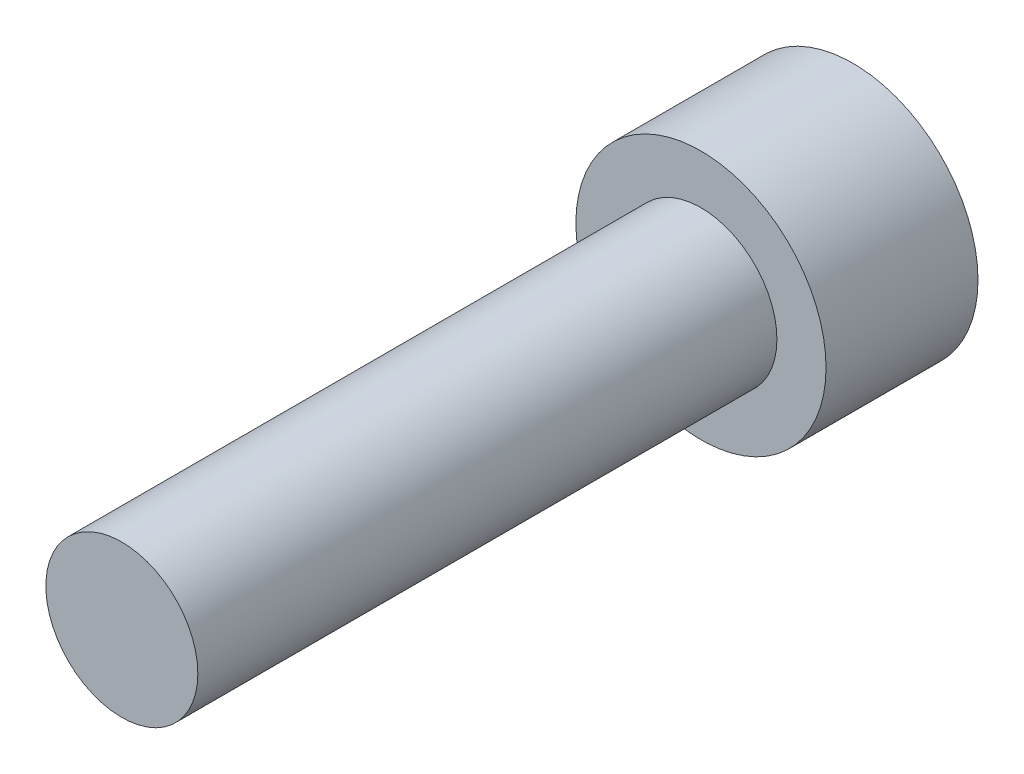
ISO-10303-21;
HEADER;
FILE_DESCRIPTION(('STEP AP214'),'2;1');
FILE_NAME('part.step','',(''),(''),'','','');
FILE_SCHEMA(('AUTOMOTIVE_DESIGN { 1 0 10303 214 1 1 1 1 }'));
ENDSEC;
DATA;
#1=APPLICATION_CONTEXT('core data for automotive mechanical design processes');
#2=APPLICATION_PROTOCOL_DEFINITION('international standard','automotive_design',2000,#1);
#3=PRODUCT_CONTEXT('',#1,'mechanical');
#4=PRODUCT('Part','Part','',(#3));
#5=PRODUCT_RELATED_PRODUCT_CATEGORY('part','',(#4));
#6=PRODUCT_DEFINITION_FORMATION('','',#4);
#7=PRODUCT_DEFINITION_CONTEXT('part definition',#1,'design');
#8=PRODUCT_DEFINITION('design','',#6,#7);
#9=PRODUCT_DEFINITION_SHAPE('','',#8);
#10=(LENGTH_UNIT() NAMED_UNIT(*) SI_UNIT(.MILLI.,.METRE.));
#11=(NAMED_UNIT(*) PLANE_ANGLE_UNIT() SI_UNIT($,.RADIAN.));
#12=(NAMED_UNIT(*) SI_UNIT($,.STERADIAN.) SOLID_ANGLE_UNIT());
#13=UNCERTAINTY_MEASURE_WITH_UNIT(LENGTH_MEASURE(1.E-05),#10,'distance_accuracy_value','');
#14=(GEOMETRIC_REPRESENTATION_CONTEXT(3) GLOBAL_UNCERTAINTY_ASSIGNED_CONTEXT((#13)) GLOBAL_UNIT_ASSIGNED_CONTEXT((#10,
#11,#12)) REPRESENTATION_CONTEXT('',''));
#15=CARTESIAN_POINT('',(0.,0.,0.));
#16=DIRECTION('',(0.,0.,1.));
#17=DIRECTION('',(1.,0.,0.));
#18=AXIS2_PLACEMENT_3D('',#15,#16,#17);
#19=CARTESIAN_POINT('',(0.,0.,15.875));
#20=DIRECTION('',(0.,0.,1.));
#21=DIRECTION('',(1.,0.,0.));
#22=AXIS2_PLACEMENT_3D('',#19,#20,#21);
#23=PLANE('',#22);
#24=CARTESIAN_POINT('',(0.,0.,15.875));
#25=DIRECTION('',(0.,0.,1.));
#26=DIRECTION('',(1.,0.,0.));
#27=AXIS2_PLACEMENT_3D('',#24,#25,#26);
#28=CIRCLE('',#27,2.0828);
#29=CARTESIAN_POINT('',(2.0828,0.,15.875));
#30=VERTEX_POINT('',#29);
#31=EDGE_CURVE('E11',#30,#30,#28,.T.);
#32=ORIENTED_EDGE('',*,*,#31,.T.);
#33=EDGE_LOOP('',(#32));
#34=FACE_BOUND('',#33,.T.);
#35=ADVANCED_FACE('F32',(#34),#23,.T.);
#36=CARTESIAN_POINT('',(0.,0.,15.875));
#37=DIRECTION('',(0.,0.,1.));
#38=DIRECTION('',(1.,0.,0.));
#39=AXIS2_PLACEMENT_3D('',#36,#37,#38);
#40=CYLINDRICAL_SURFACE('',#39,2.0828);
#41=CARTESIAN_POINT('',(0.,0.,0.));
#42=DIRECTION('',(0.,0.,1.));
#43=DIRECTION('',(1.,0.,0.));
#44=AXIS2_PLACEMENT_3D('',#41,#42,#43);
#45=CIRCLE('',#44,2.0828);
#46=CARTESIAN_POINT('',(2.0828,0.,0.));
#47=VERTEX_POINT('',#46);
#48=EDGE_CURVE('E39',#47,#47,#45,.T.);
#49=ORIENTED_EDGE('',*,*,#48,.T.);
#50=EDGE_LOOP('',(#49));
#51=FACE_BOUND('',#50,.T.);
#52=ORIENTED_EDGE('',*,*,#31,.F.);
#53=EDGE_LOOP('',(#52));
#54=FACE_BOUND('',#53,.T.);
#55=ADVANCED_FACE('F146',(#51,#54),#40,.T.);
#56=CARTESIAN_POINT('',(0.,-2.0828,0.));
#57=DIRECTION('',(0.,0.,1.));
#58=DIRECTION('',(1.,0.,0.));
#59=AXIS2_PLACEMENT_3D('',#56,#57,#58);
#60=PLANE('',#59);
#61=CARTESIAN_POINT('',(0.,0.,0.));
#62=DIRECTION('',(0.,0.,1.));
#63=DIRECTION('',(1.,0.,0.));
#64=AXIS2_PLACEMENT_3D('',#61,#62,#63);
#65=CIRCLE('',#64,3.429);
#66=CARTESIAN_POINT('',(3.429,0.,0.));
#67=VERTEX_POINT('',#66);
#68=EDGE_CURVE('E141',#67,#67,#65,.T.);
#69=ORIENTED_EDGE('',*,*,#68,.T.);
#70=EDGE_LOOP('',(#69));
#71=FACE_BOUND('',#70,.T.);
#72=ORIENTED_EDGE('',*,*,#48,.F.);
#73=EDGE_LOOP('',(#72));
#74=FACE_BOUND('',#73,.T.);
#75=ADVANCED_FACE('F149',(#71,#74),#60,.T.);
#76=CARTESIAN_POINT('',(0.,0.,15.875));
#77=DIRECTION('',(0.,0.,1.));
#78=DIRECTION('',(1.,0.,0.));
#79=AXIS2_PLACEMENT_3D('',#76,#77,#78);
#80=CYLINDRICAL_SURFACE('',#79,3.429);
#81=CARTESIAN_POINT('',(0.,0.,-4.1656));
#82=DIRECTION('',(0.,0.,1.));
#83=DIRECTION('',(1.,0.,0.));
#84=AXIS2_PLACEMENT_3D('',#81,#82,#83);
#85=CIRCLE('',#84,3.429);
#86=CARTESIAN_POINT('',(3.429,0.,-4.1656));
#87=VERTEX_POINT('',#86);
#88=EDGE_CURVE('E133',#87,#87,#85,.T.);
#89=ORIENTED_EDGE('',*,*,#88,.T.);
#90=EDGE_LOOP('',(#89));
#91=FACE_BOUND('',#90,.T.);
#92=ORIENTED_EDGE('',*,*,#68,.F.);
#93=EDGE_LOOP('',(#92));
#94=FACE_BOUND('',#93,.T.);
#95=ADVANCED_FACE('F151',(#91,#94),#80,.T.);
#96=CARTESIAN_POINT('',(0.,-3.429,-4.1656));
#97=DIRECTION('',(0.,0.,-1.));
#98=DIRECTION('',(-1.,0.,0.));
#99=AXIS2_PLACEMENT_3D('',#96,#97,#98);
#100=PLANE('',#99);
#101=DIRECTION('',(0.866025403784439,-0.5,0.));
#102=VECTOR('',#101,1.);
#103=CARTESIAN_POINT('',(0.,2.05305755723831,-4.1656));
#104=LINE('',#103,#102);
#105=CARTESIAN_POINT('',(0.,2.05305755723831,-4.1656));
#106=VERTEX_POINT('',#105);
#107=CARTESIAN_POINT('',(1.778,1.02652877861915,-4.1656));
#108=VERTEX_POINT('',#107);
#109=EDGE_CURVE('E46',#106,#108,#104,.T.);
#110=ORIENTED_EDGE('',*,*,#109,.F.);
#111=DIRECTION('',(0.866025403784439,0.5,0.));
#112=VECTOR('',#111,1.);
#113=CARTESIAN_POINT('',(-1.778,1.02652877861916,-4.1656));
#114=LINE('',#113,#112);
#115=CARTESIAN_POINT('',(-1.778,1.02652877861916,-4.1656));
#116=VERTEX_POINT('',#115);
#117=EDGE_CURVE('E129',#116,#106,#114,.T.);
#118=ORIENTED_EDGE('',*,*,#117,.F.);
#119=DIRECTION('',(0.,1.,0.));
#120=VECTOR('',#119,1.);
#121=CARTESIAN_POINT('',(-1.778,-1.02652877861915,-4.1656));
#122=LINE('',#121,#120);
#123=CARTESIAN_POINT('',(-1.778,-1.02652877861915,-4.1656));
#124=VERTEX_POINT('',#123);
#125=EDGE_CURVE('E127',#124,#116,#122,.T.);
#126=ORIENTED_EDGE('',*,*,#125,.F.);
#127=DIRECTION('',(-0.866025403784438,0.5,0.));
#128=VECTOR('',#127,1.);
#129=CARTESIAN_POINT('',(0.,-2.05305755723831,-4.1656));
#130=LINE('',#129,#128);
#131=CARTESIAN_POINT('',(0.,-2.05305755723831,-4.1656));
#132=VERTEX_POINT('',#131);
#133=EDGE_CURVE('E94',#132,#124,#130,.T.);
#134=ORIENTED_EDGE('',*,*,#133,.F.);
#135=DIRECTION('',(-0.866025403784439,-0.5,0.));
#136=VECTOR('',#135,1.);
#137=CARTESIAN_POINT('',(1.778,-1.02652877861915,-4.1656));
#138=LINE('',#137,#136);
#139=CARTESIAN_POINT('',(1.778,-1.02652877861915,-4.1656));
#140=VERTEX_POINT('',#139);
#141=EDGE_CURVE('E123',#140,#132,#138,.T.);
#142=ORIENTED_EDGE('',*,*,#141,.F.);
#143=DIRECTION('',(0.,-1.,0.));
#144=VECTOR('',#143,1.);
#145=CARTESIAN_POINT('',(1.778,1.02652877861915,-4.1656));
#146=LINE('',#145,#144);
#147=EDGE_CURVE('E120',#108,#140,#146,.T.);
#148=ORIENTED_EDGE('',*,*,#147,.F.);
#149=EDGE_LOOP('',(#110,#118,#126,#134,#142,#148));
#150=FACE_BOUND('',#149,.T.);
#151=ORIENTED_EDGE('',*,*,#88,.F.);
#152=EDGE_LOOP('',(#151));
#153=FACE_BOUND('',#152,.T.);
#154=ADVANCED_FACE('F158',(#150,#153),#100,.T.);
#155=CARTESIAN_POINT('',(0.,2.05305755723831,-1.3716));
#156=DIRECTION('',(0.5,0.866025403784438,0.));
#157=DIRECTION('',(-0.866025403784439,0.5,0.));
#158=AXIS2_PLACEMENT_3D('',#155,#156,#157);
#159=PLANE('',#158);
#160=ORIENTED_EDGE('',*,*,#109,.T.);
#161=DIRECTION('',(0.,0.,-1.));
#162=VECTOR('',#161,1.);
#163=CARTESIAN_POINT('',(1.778,1.02652877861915,-1.3716));
#164=LINE('',#163,#162);
#165=CARTESIAN_POINT('',(1.778,1.02652877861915,-1.3716));
#166=VERTEX_POINT('',#165);
#167=EDGE_CURVE('E76',#166,#108,#164,.T.);
#168=ORIENTED_EDGE('',*,*,#167,.F.);
#169=DIRECTION('',(0.866025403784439,-0.5,0.));
#170=VECTOR('',#169,1.);
#171=CARTESIAN_POINT('',(0.,2.05305755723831,-1.3716));
#172=LINE('',#171,#170);
#173=CARTESIAN_POINT('',(0.,2.05305755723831,-1.3716));
#174=VERTEX_POINT('',#173);
#175=EDGE_CURVE('E131',#174,#166,#172,.T.);
#176=ORIENTED_EDGE('',*,*,#175,.F.);
#177=DIRECTION('',(0.,0.,-1.));
#178=VECTOR('',#177,1.);
#179=CARTESIAN_POINT('',(0.,2.05305755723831,-1.3716));
#180=LINE('',#179,#178);
#181=EDGE_CURVE('E54',#174,#106,#180,.T.);
#182=ORIENTED_EDGE('',*,*,#181,.T.);
#183=EDGE_LOOP('',(#160,#168,#176,#182));
#184=FACE_BOUND('',#183,.T.);
#185=ADVANCED_FACE('F189',(#184),#159,.F.);
#186=CARTESIAN_POINT('',(-1.778,1.02652877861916,-1.3716));
#187=DIRECTION('',(-0.5,0.866025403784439,0.));
#188=DIRECTION('',(-0.866025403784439,-0.5,0.));
#189=AXIS2_PLACEMENT_3D('',#186,#187,#188);
#190=PLANE('',#189);
#191=ORIENTED_EDGE('',*,*,#117,.T.);
#192=ORIENTED_EDGE('',*,*,#181,.F.);
#193=DIRECTION('',(0.866025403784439,0.5,0.));
#194=VECTOR('',#193,1.);
#195=CARTESIAN_POINT('',(-1.778,1.02652877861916,-1.3716));
#196=LINE('',#195,#194);
#197=CARTESIAN_POINT('',(-1.778,1.02652877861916,-1.3716));
#198=VERTEX_POINT('',#197);
#199=EDGE_CURVE('E106',#198,#174,#196,.T.);
#200=ORIENTED_EDGE('',*,*,#199,.F.);
#201=DIRECTION('',(0.,0.,-1.));
#202=VECTOR('',#201,1.);
#203=CARTESIAN_POINT('',(-1.778,1.02652877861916,-1.3716));
#204=LINE('',#203,#202);
#205=EDGE_CURVE('E98',#198,#116,#204,.T.);
#206=ORIENTED_EDGE('',*,*,#205,.T.);
#207=EDGE_LOOP('',(#191,#192,#200,#206));
#208=FACE_BOUND('',#207,.T.);
#209=ADVANCED_FACE('F199',(#208),#190,.F.);
#210=CARTESIAN_POINT('',(-1.778,-1.02652877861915,-1.3716));
#211=DIRECTION('',(-1.,0.,0.));
#212=DIRECTION('',(0.,0.,1.));
#213=AXIS2_PLACEMENT_3D('',#210,#211,#212);
#214=PLANE('',#213);
#215=ORIENTED_EDGE('',*,*,#125,.T.);
#216=ORIENTED_EDGE('',*,*,#205,.F.);
#217=DIRECTION('',(0.,1.,0.));
#218=VECTOR('',#217,1.);
#219=CARTESIAN_POINT('',(-1.778,-1.02652877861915,-1.3716));
#220=LINE('',#219,#218);
#221=CARTESIAN_POINT('',(-1.778,-1.02652877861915,-1.3716));
#222=VERTEX_POINT('',#221);
#223=EDGE_CURVE('E102',#222,#198,#220,.T.);
#224=ORIENTED_EDGE('',*,*,#223,.F.);
#225=DIRECTION('',(0.,0.,-1.));
#226=VECTOR('',#225,1.);
#227=CARTESIAN_POINT('',(-1.778,-1.02652877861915,-1.3716));
#228=LINE('',#227,#226);
#229=EDGE_CURVE('E87',#222,#124,#228,.T.);
#230=ORIENTED_EDGE('',*,*,#229,.T.);
#231=EDGE_LOOP('',(#215,#216,#224,#230));
#232=FACE_BOUND('',#231,.T.);
#233=ADVANCED_FACE('F103',(#232),#214,.F.);
#234=CARTESIAN_POINT('',(0.,-2.05305755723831,-1.3716));
#235=DIRECTION('',(-0.5,-0.866025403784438,0.));
#236=DIRECTION('',(0.866025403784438,-0.5,0.));
#237=AXIS2_PLACEMENT_3D('',#234,#235,#236);
#238=PLANE('',#237);
#239=ORIENTED_EDGE('',*,*,#133,.T.);
#240=ORIENTED_EDGE('',*,*,#229,.F.);
#241=DIRECTION('',(-0.866025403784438,0.5,0.));
#242=VECTOR('',#241,1.);
#243=CARTESIAN_POINT('',(0.,-2.05305755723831,-1.3716));
#244=LINE('',#243,#242);
#245=CARTESIAN_POINT('',(0.,-2.05305755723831,-1.3716));
#246=VERTEX_POINT('',#245);
#247=EDGE_CURVE('E91',#246,#222,#244,.T.);
#248=ORIENTED_EDGE('',*,*,#247,.F.);
#249=DIRECTION('',(0.,0.,-1.));
#250=VECTOR('',#249,1.);
#251=CARTESIAN_POINT('',(0.,-2.05305755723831,-1.3716));
#252=LINE('',#251,#250);
#253=EDGE_CURVE('E99',#246,#132,#252,.T.);
#254=ORIENTED_EDGE('',*,*,#253,.T.);
#255=EDGE_LOOP('',(#239,#240,#248,#254));
#256=FACE_BOUND('',#255,.T.);
#257=ADVANCED_FACE('F89',(#256),#238,.F.);
#258=CARTESIAN_POINT('',(1.778,-1.02652877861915,-1.3716));
#259=DIRECTION('',(0.5,-0.866025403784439,0.));
#260=DIRECTION('',(0.866025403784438,0.5,0.));
#261=AXIS2_PLACEMENT_3D('',#258,#259,#260);
#262=PLANE('',#261);
#263=ORIENTED_EDGE('',*,*,#141,.T.);
#264=ORIENTED_EDGE('',*,*,#253,.F.);
#265=DIRECTION('',(-0.866025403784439,-0.5,0.));
#266=VECTOR('',#265,1.);
#267=CARTESIAN_POINT('',(1.778,-1.02652877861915,-1.3716));
#268=LINE('',#267,#266);
#269=CARTESIAN_POINT('',(1.778,-1.02652877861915,-1.3716));
#270=VERTEX_POINT('',#269);
#271=EDGE_CURVE('E112',#270,#246,#268,.T.);
#272=ORIENTED_EDGE('',*,*,#271,.F.);
#273=DIRECTION('',(0.,0.,-1.));
#274=VECTOR('',#273,1.);
#275=CARTESIAN_POINT('',(1.778,-1.02652877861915,-1.3716));
#276=LINE('',#275,#274);
#277=EDGE_CURVE('E136',#270,#140,#276,.T.);
#278=ORIENTED_EDGE('',*,*,#277,.T.);
#279=EDGE_LOOP('',(#263,#264,#272,#278));
#280=FACE_BOUND('',#279,.T.);
#281=ADVANCED_FACE('F224',(#280),#262,.F.);
#282=CARTESIAN_POINT('',(1.778,1.02652877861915,-1.3716));
#283=DIRECTION('',(1.,0.,0.));
#284=DIRECTION('',(0.,0.,-1.));
#285=AXIS2_PLACEMENT_3D('',#282,#283,#284);
#286=PLANE('',#285);
#287=ORIENTED_EDGE('',*,*,#147,.T.);
#288=ORIENTED_EDGE('',*,*,#277,.F.);
#289=DIRECTION('',(0.,-1.,0.));
#290=VECTOR('',#289,1.);
#291=CARTESIAN_POINT('',(1.778,1.02652877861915,-1.3716));
#292=LINE('',#291,#290);
#293=EDGE_CURVE('E114',#166,#270,#292,.T.);
#294=ORIENTED_EDGE('',*,*,#293,.F.);
#295=ORIENTED_EDGE('',*,*,#167,.T.);
#296=EDGE_LOOP('',(#287,#288,#294,#295));
#297=FACE_BOUND('',#296,.T.);
#298=ADVANCED_FACE('F233',(#297),#286,.F.);
#299=CARTESIAN_POINT('',(3.556,0.,-1.3716));
#300=DIRECTION('',(0.,0.,-1.));
#301=DIRECTION('',(-1.,0.,0.));
#302=AXIS2_PLACEMENT_3D('',#299,#300,#301);
#303=PLANE('',#302);
#304=ORIENTED_EDGE('',*,*,#175,.T.);
#305=ORIENTED_EDGE('',*,*,#293,.T.);
#306=ORIENTED_EDGE('',*,*,#271,.T.);
#307=ORIENTED_EDGE('',*,*,#247,.T.);
#308=ORIENTED_EDGE('',*,*,#223,.T.);
#309=ORIENTED_EDGE('',*,*,#199,.T.);
#310=EDGE_LOOP('',(#304,#305,#306,#307,#308,#309));
#311=FACE_BOUND('',#310,.T.);
#312=ADVANCED_FACE('F109',(#311),#303,.T.);
#313=CLOSED_SHELL('',(#35,#55,#75,#95,#154,#185,#209,#233,#257,#281,#298,#312));
#314=MANIFOLD_SOLID_BREP('B2',#313);
#315=ADVANCED_BREP_SHAPE_REPRESENTATION('',(#18,#314),#14);
#316=SHAPE_DEFINITION_REPRESENTATION(#9,#315);
ENDSEC;
END-ISO-10303-21;
